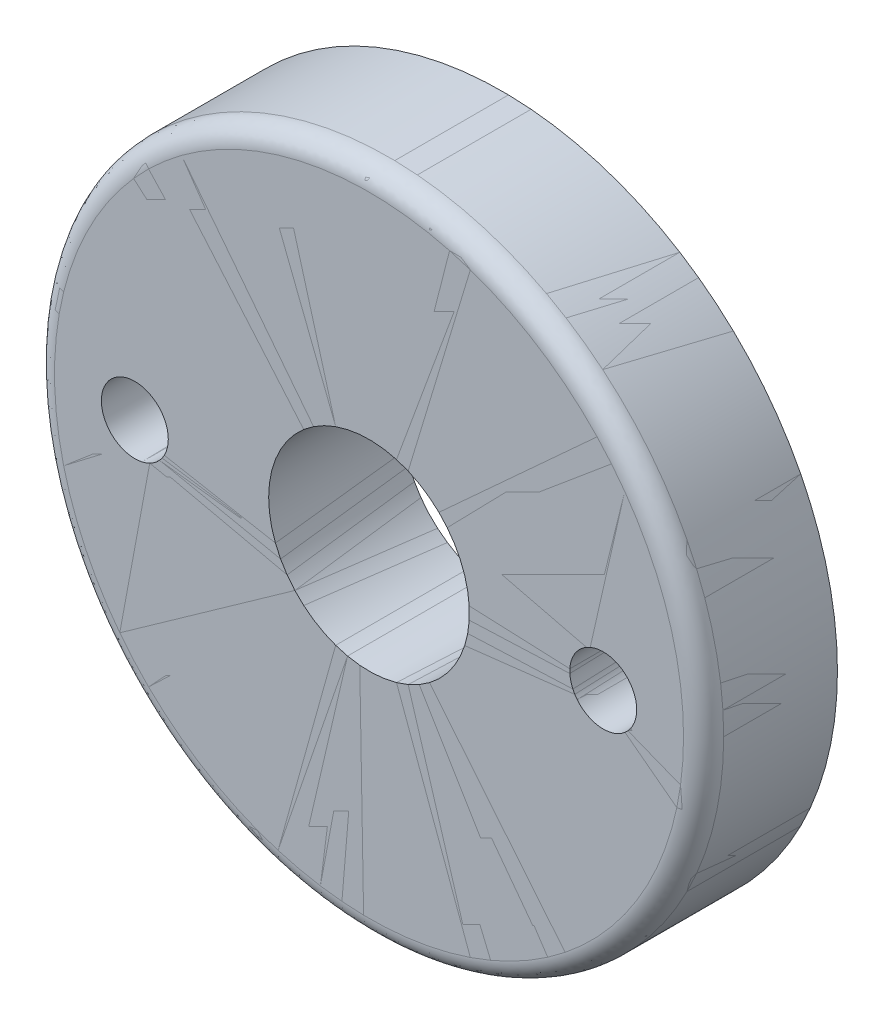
ISO-10303-21;
HEADER;
FILE_DESCRIPTION(('STEP AP214'),'2;1');
FILE_NAME('part.step','',(''),(''),'','','');
FILE_SCHEMA(('AUTOMOTIVE_DESIGN { 1 0 10303 214 1 1 1 1 }'));
ENDSEC;
DATA;
#1=APPLICATION_CONTEXT('core data for automotive mechanical design processes');
#2=APPLICATION_PROTOCOL_DEFINITION('international standard','automotive_design',2000,#1);
#3=PRODUCT_CONTEXT('',#1,'mechanical');
#4=PRODUCT('Part','Part','',(#3));
#5=PRODUCT_RELATED_PRODUCT_CATEGORY('part','',(#4));
#6=PRODUCT_DEFINITION_FORMATION('','',#4);
#7=PRODUCT_DEFINITION_CONTEXT('part definition',#1,'design');
#8=PRODUCT_DEFINITION('design','',#6,#7);
#9=PRODUCT_DEFINITION_SHAPE('','',#8);
#10=(LENGTH_UNIT() NAMED_UNIT(*) SI_UNIT(.MILLI.,.METRE.));
#11=(NAMED_UNIT(*) PLANE_ANGLE_UNIT() SI_UNIT($,.RADIAN.));
#12=(NAMED_UNIT(*) SI_UNIT($,.STERADIAN.) SOLID_ANGLE_UNIT());
#13=UNCERTAINTY_MEASURE_WITH_UNIT(LENGTH_MEASURE(1.E-05),#10,'distance_accuracy_value','');
#14=(GEOMETRIC_REPRESENTATION_CONTEXT(3) GLOBAL_UNCERTAINTY_ASSIGNED_CONTEXT((#13)) GLOBAL_UNIT_ASSIGNED_CONTEXT((#10,
#11,#12)) REPRESENTATION_CONTEXT('',''));
#15=CARTESIAN_POINT('',(0.,0.,0.));
#16=DIRECTION('',(0.,0.,1.));
#17=DIRECTION('',(1.,0.,0.));
#18=AXIS2_PLACEMENT_3D('',#15,#16,#17);
#19=CARTESIAN_POINT('',(4.7,0.,0.));
#20=CARTESIAN_POINT('',(5.,0.,0.));
#21=CARTESIAN_POINT('',(5.,0.,-0.3));
#22=CARTESIAN_POINT('',(5.,0.,-0.6));
#23=CARTESIAN_POINT('',(4.7,0.,-0.6));
#24=CARTESIAN_POINT('',(4.4,0.,-0.6));
#25=CARTESIAN_POINT('',(4.4,0.,-0.3));
#26=CARTESIAN_POINT('',(4.4,0.,0.));
#27=CARTESIAN_POINT('',(4.7,0.,0.));
#28=(BOUNDED_CURVE() B_SPLINE_CURVE(2,(#19,#20,#21,#22,#23,#24,#25,#26,#27),.UNSPECIFIED.,.T.,
.F.) B_SPLINE_CURVE_WITH_KNOTS((3,2,2,2,3),(0.,0.25,0.5,0.75,1.),
.UNSPECIFIED.) CURVE() GEOMETRIC_REPRESENTATION_ITEM() RATIONAL_B_SPLINE_CURVE((1.,
0.70710678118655,1.,0.70710678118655,1.,0.70710678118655,1.,0.70710678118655,1.)) REPRESENTATION_ITEM(''));
#29=CARTESIAN_POINT('',(0.,0.,-0.6));
#30=DIRECTION('',(0.,0.,1.));
#31=AXIS1_PLACEMENT('',#29,#30);
#32=SURFACE_OF_REVOLUTION('',#28,#31);
#33=CARTESIAN_POINT('',(0.,0.,-0.3));
#34=DIRECTION('',(0.,0.,1.));
#35=DIRECTION('',(1.,0.,0.));
#36=AXIS2_PLACEMENT_3D('',#33,#34,#35);
#37=CIRCLE('',#36,5.);
#38=CARTESIAN_POINT('',(5.,0.,-0.3));
#39=VERTEX_POINT('',#38);
#40=EDGE_CURVE('P0_E396',#39,#39,#37,.T.);
#41=ORIENTED_EDGE('',*,*,#40,.T.);
#42=EDGE_LOOP('',(#41));
#43=FACE_BOUND('',#42,.T.);
#44=CARTESIAN_POINT('',(0.,0.,0.));
#45=DIRECTION('',(0.,0.,-1.));
#46=DIRECTION('',(1.,0.,0.));
#47=AXIS2_PLACEMENT_3D('',#44,#45,#46);
#48=CIRCLE('',#47,4.7);
#49=CARTESIAN_POINT('',(4.7,0.,0.));
#50=VERTEX_POINT('',#49);
#51=EDGE_CURVE('P0_E392',#50,#50,#48,.F.);
#52=ORIENTED_EDGE('',*,*,#51,.F.);
#53=EDGE_LOOP('',(#52));
#54=FACE_BOUND('',#53,.T.);
#55=ADVANCED_FACE('P0_F348',(#43,#54),#32,.F.);
#56=CARTESIAN_POINT('',(0.,0.,-2.));
#57=DIRECTION('',(0.,0.,1.));
#58=DIRECTION('',(1.,0.,0.));
#59=AXIS2_PLACEMENT_3D('',#56,#57,#58);
#60=CYLINDRICAL_SURFACE('',#59,5.);
#61=CARTESIAN_POINT('',(0.,0.,-2.));
#62=DIRECTION('',(0.,0.,1.));
#63=DIRECTION('',(1.,0.,0.));
#64=AXIS2_PLACEMENT_3D('',#61,#62,#63);
#65=CIRCLE('',#64,5.);
#66=CARTESIAN_POINT('',(5.,0.,-2.));
#67=VERTEX_POINT('',#66);
#68=EDGE_CURVE('P0_E379',#67,#67,#65,.F.);
#69=ORIENTED_EDGE('',*,*,#68,.F.);
#70=EDGE_LOOP('',(#69));
#71=FACE_BOUND('',#70,.T.);
#72=ORIENTED_EDGE('',*,*,#40,.F.);
#73=EDGE_LOOP('',(#72));
#74=FACE_BOUND('',#73,.T.);
#75=ADVANCED_FACE('P0_F423',(#71,#74),#60,.T.);
#76=CARTESIAN_POINT('',(3.5,0.,-2.));
#77=DIRECTION('',(0.,0.,1.));
#78=DIRECTION('',(1.,0.,0.));
#79=AXIS2_PLACEMENT_3D('',#76,#77,#78);
#80=CYLINDRICAL_SURFACE('',#79,0.5);
#81=CARTESIAN_POINT('',(3.5,0.,-2.));
#82=DIRECTION('',(0.,0.,1.));
#83=DIRECTION('',(1.,0.,0.));
#84=AXIS2_PLACEMENT_3D('',#81,#82,#83);
#85=CIRCLE('',#84,0.5);
#86=CARTESIAN_POINT('',(4.,0.,-2.));
#87=VERTEX_POINT('',#86);
#88=EDGE_CURVE('P0_E374',#87,#87,#85,.T.);
#89=ORIENTED_EDGE('',*,*,#88,.F.);
#90=EDGE_LOOP('',(#89));
#91=FACE_BOUND('',#90,.T.);
#92=CARTESIAN_POINT('',(3.5,0.,0.));
#93=DIRECTION('',(0.,0.,1.));
#94=DIRECTION('',(1.,0.,0.));
#95=AXIS2_PLACEMENT_3D('',#92,#93,#94);
#96=CIRCLE('',#95,0.5);
#97=CARTESIAN_POINT('',(4.,0.,0.));
#98=VERTEX_POINT('',#97);
#99=EDGE_CURVE('P0_E389',#98,#98,#96,.F.);
#100=ORIENTED_EDGE('',*,*,#99,.F.);
#101=EDGE_LOOP('',(#100));
#102=FACE_BOUND('',#101,.T.);
#103=ADVANCED_FACE('P0_F426',(#91,#102),#80,.F.);
#104=CARTESIAN_POINT('',(-3.5,0.,-2.));
#105=DIRECTION('',(0.,0.,1.));
#106=DIRECTION('',(1.,0.,0.));
#107=AXIS2_PLACEMENT_3D('',#104,#105,#106);
#108=CYLINDRICAL_SURFACE('',#107,0.5);
#109=CARTESIAN_POINT('',(-3.5,0.,-2.));
#110=DIRECTION('',(0.,0.,1.));
#111=DIRECTION('',(1.,0.,0.));
#112=AXIS2_PLACEMENT_3D('',#109,#110,#111);
#113=CIRCLE('',#112,0.5);
#114=CARTESIAN_POINT('',(-3.,0.,-2.));
#115=VERTEX_POINT('',#114);
#116=EDGE_CURVE('P0_E361',#115,#115,#113,.T.);
#117=ORIENTED_EDGE('',*,*,#116,.F.);
#118=EDGE_LOOP('',(#117));
#119=FACE_BOUND('',#118,.T.);
#120=CARTESIAN_POINT('',(-3.5,0.,0.));
#121=DIRECTION('',(0.,0.,1.));
#122=DIRECTION('',(1.,0.,0.));
#123=AXIS2_PLACEMENT_3D('',#120,#121,#122);
#124=CIRCLE('',#123,0.5);
#125=CARTESIAN_POINT('',(-3.,0.,0.));
#126=VERTEX_POINT('',#125);
#127=EDGE_CURVE('P0_E384',#126,#126,#124,.F.);
#128=ORIENTED_EDGE('',*,*,#127,.F.);
#129=EDGE_LOOP('',(#128));
#130=FACE_BOUND('',#129,.T.);
#131=ADVANCED_FACE('P0_F430',(#119,#130),#108,.F.);
#132=CARTESIAN_POINT('',(-4.7,-4.7,0.));
#133=DIRECTION('',(0.,0.,1.));
#134=DIRECTION('',(1.,0.,0.));
#135=AXIS2_PLACEMENT_3D('',#132,#133,#134);
#136=PLANE('',#135);
#137=ORIENTED_EDGE('',*,*,#127,.T.);
#138=EDGE_LOOP('',(#137));
#139=FACE_BOUND('',#138,.T.);
#140=ORIENTED_EDGE('',*,*,#99,.T.);
#141=EDGE_LOOP('',(#140));
#142=FACE_BOUND('',#141,.T.);
#143=CARTESIAN_POINT('',(0.,0.,0.));
#144=DIRECTION('',(0.,0.,-1.));
#145=DIRECTION('',(-1.,0.,0.));
#146=AXIS2_PLACEMENT_3D('',#143,#144,#145);
#147=CIRCLE('',#146,1.5);
#148=CARTESIAN_POINT('',(-1.5,0.,0.));
#149=VERTEX_POINT('',#148);
#150=EDGE_CURVE('P0_E356',#149,#149,#147,.F.);
#151=ORIENTED_EDGE('',*,*,#150,.F.);
#152=EDGE_LOOP('',(#151));
#153=FACE_BOUND('',#152,.T.);
#154=ORIENTED_EDGE('',*,*,#51,.T.);
#155=EDGE_LOOP('',(#154));
#156=FACE_BOUND('',#155,.T.);
#157=ADVANCED_FACE('P0_F434',(#139,#142,#153,#156),#136,.T.);
#158=CARTESIAN_POINT('',(5.,-5.,-2.));
#159=DIRECTION('',(0.,0.,-1.));
#160=DIRECTION('',(-1.,0.,0.));
#161=AXIS2_PLACEMENT_3D('',#158,#159,#160);
#162=PLANE('',#161);
#163=ORIENTED_EDGE('',*,*,#116,.T.);
#164=EDGE_LOOP('',(#163));
#165=FACE_BOUND('',#164,.T.);
#166=ORIENTED_EDGE('',*,*,#88,.T.);
#167=EDGE_LOOP('',(#166));
#168=FACE_BOUND('',#167,.T.);
#169=CARTESIAN_POINT('',(0.,0.,-2.));
#170=DIRECTION('',(0.,0.,-1.));
#171=DIRECTION('',(-1.,0.,0.));
#172=AXIS2_PLACEMENT_3D('',#169,#170,#171);
#173=CIRCLE('',#172,1.5);
#174=CARTESIAN_POINT('',(-1.5,0.,-2.));
#175=VERTEX_POINT('',#174);
#176=EDGE_CURVE('P0_E10',#175,#175,#173,.T.);
#177=ORIENTED_EDGE('',*,*,#176,.F.);
#178=EDGE_LOOP('',(#177));
#179=FACE_BOUND('',#178,.T.);
#180=ORIENTED_EDGE('',*,*,#68,.T.);
#181=EDGE_LOOP('',(#180));
#182=FACE_BOUND('',#181,.T.);
#183=ADVANCED_FACE('P0_F350',(#165,#168,#179,#182),#162,.T.);
#184=CARTESIAN_POINT('',(0.,0.,0.));
#185=DIRECTION('',(0.,0.,-1.));
#186=DIRECTION('',(-1.,0.,0.));
#187=AXIS2_PLACEMENT_3D('',#184,#185,#186);
#188=CYLINDRICAL_SURFACE('',#187,1.5);
#189=ORIENTED_EDGE('',*,*,#176,.T.);
#190=EDGE_LOOP('',(#189));
#191=FACE_BOUND('',#190,.T.);
#192=ORIENTED_EDGE('',*,*,#150,.T.);
#193=EDGE_LOOP('',(#192));
#194=FACE_BOUND('',#193,.T.);
#195=ADVANCED_FACE('P0_F436',(#191,#194),#188,.F.);
#196=CLOSED_SHELL('',(#55,#75,#103,#131,#157,#183,#195));
#197=MANIFOLD_SOLID_BREP('P0_B2',#196);
#198=CARTESIAN_POINT('',(4.7,0.,0.));
#199=CARTESIAN_POINT('',(5.,0.,0.));
#200=CARTESIAN_POINT('',(5.,0.,-0.3));
#201=CARTESIAN_POINT('',(5.,0.,-0.6));
#202=CARTESIAN_POINT('',(4.7,0.,-0.6));
#203=CARTESIAN_POINT('',(4.4,0.,-0.6));
#204=CARTESIAN_POINT('',(4.4,0.,-0.3));
#205=CARTESIAN_POINT('',(4.4,0.,0.));
#206=CARTESIAN_POINT('',(4.7,0.,0.));
#207=(BOUNDED_CURVE() B_SPLINE_CURVE(2,(#198,#199,#200,#201,#202,#203,#204,#205,#206),
.UNSPECIFIED.,.T.,.F.) B_SPLINE_CURVE_WITH_KNOTS((3,2,2,2,3),(0.,0.25,0.5,0.75,1.),
.UNSPECIFIED.) CURVE() GEOMETRIC_REPRESENTATION_ITEM() RATIONAL_B_SPLINE_CURVE((1.,
0.70710678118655,1.,0.70710678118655,1.,0.70710678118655,1.,0.70710678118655,1.)) REPRESENTATION_ITEM(''));
#208=CARTESIAN_POINT('',(0.,0.,-0.6));
#209=DIRECTION('',(0.,0.,1.));
#210=AXIS1_PLACEMENT('',#208,#209);
#211=SURFACE_OF_REVOLUTION('',#207,#210);
#212=CARTESIAN_POINT('',(0.,0.,-0.3));
#213=DIRECTION('',(0.,0.,1.));
#214=DIRECTION('',(1.,0.,0.));
#215=AXIS2_PLACEMENT_3D('',#212,#213,#214);
#216=CIRCLE('',#215,5.);
#217=CARTESIAN_POINT('',(5.,0.,-0.3));
#218=VERTEX_POINT('',#217);
#219=EDGE_CURVE('P1_E62',#218,#218,#216,.T.);
#220=ORIENTED_EDGE('',*,*,#219,.T.);
#221=EDGE_LOOP('',(#220));
#222=FACE_BOUND('',#221,.T.);
#223=CARTESIAN_POINT('',(0.,0.,0.));
#224=DIRECTION('',(0.,0.,-1.));
#225=DIRECTION('',(1.,0.,0.));
#226=AXIS2_PLACEMENT_3D('',#223,#224,#225);
#227=CIRCLE('',#226,4.7);
#228=CARTESIAN_POINT('',(4.7,0.,0.));
#229=VERTEX_POINT('',#228);
#230=EDGE_CURVE('P1_E58',#229,#229,#227,.F.);
#231=ORIENTED_EDGE('',*,*,#230,.F.);
#232=EDGE_LOOP('',(#231));
#233=FACE_BOUND('',#232,.T.);
#234=ADVANCED_FACE('P1_F14',(#222,#233),#211,.F.);
#235=CARTESIAN_POINT('',(0.,0.,-2.));
#236=DIRECTION('',(0.,0.,1.));
#237=DIRECTION('',(1.,0.,0.));
#238=AXIS2_PLACEMENT_3D('',#235,#236,#237);
#239=CYLINDRICAL_SURFACE('',#238,5.);
#240=CARTESIAN_POINT('',(0.,0.,-2.));
#241=DIRECTION('',(0.,0.,1.));
#242=DIRECTION('',(1.,0.,0.));
#243=AXIS2_PLACEMENT_3D('',#240,#241,#242);
#244=CIRCLE('',#243,5.);
#245=CARTESIAN_POINT('',(5.,0.,-2.));
#246=VERTEX_POINT('',#245);
#247=EDGE_CURVE('P1_E45',#246,#246,#244,.F.);
#248=ORIENTED_EDGE('',*,*,#247,.F.);
#249=EDGE_LOOP('',(#248));
#250=FACE_BOUND('',#249,.T.);
#251=ORIENTED_EDGE('',*,*,#219,.F.);
#252=EDGE_LOOP('',(#251));
#253=FACE_BOUND('',#252,.T.);
#254=ADVANCED_FACE('P1_F88',(#250,#253),#239,.T.);
#255=CARTESIAN_POINT('',(3.5,0.,-2.));
#256=DIRECTION('',(0.,0.,1.));
#257=DIRECTION('',(1.,0.,0.));
#258=AXIS2_PLACEMENT_3D('',#255,#256,#257);
#259=CYLINDRICAL_SURFACE('',#258,0.5);
#260=CARTESIAN_POINT('',(3.5,0.,-2.));
#261=DIRECTION('',(0.,0.,1.));
#262=DIRECTION('',(1.,0.,0.));
#263=AXIS2_PLACEMENT_3D('',#260,#261,#262);
#264=CIRCLE('',#263,0.5);
#265=CARTESIAN_POINT('',(4.,0.,-2.));
#266=VERTEX_POINT('',#265);
#267=EDGE_CURVE('P1_E40',#266,#266,#264,.T.);
#268=ORIENTED_EDGE('',*,*,#267,.F.);
#269=EDGE_LOOP('',(#268));
#270=FACE_BOUND('',#269,.T.);
#271=CARTESIAN_POINT('',(3.5,0.,0.));
#272=DIRECTION('',(0.,0.,1.));
#273=DIRECTION('',(1.,0.,0.));
#274=AXIS2_PLACEMENT_3D('',#271,#272,#273);
#275=CIRCLE('',#274,0.5);
#276=CARTESIAN_POINT('',(4.,0.,0.));
#277=VERTEX_POINT('',#276);
#278=EDGE_CURVE('P1_E55',#277,#277,#275,.F.);
#279=ORIENTED_EDGE('',*,*,#278,.F.);
#280=EDGE_LOOP('',(#279));
#281=FACE_BOUND('',#280,.T.);
#282=ADVANCED_FACE('P1_F90',(#270,#281),#259,.F.);
#283=CARTESIAN_POINT('',(-3.5,0.,-2.));
#284=DIRECTION('',(0.,0.,1.));
#285=DIRECTION('',(1.,0.,0.));
#286=AXIS2_PLACEMENT_3D('',#283,#284,#285);
#287=CYLINDRICAL_SURFACE('',#286,0.5);
#288=CARTESIAN_POINT('',(-3.5,0.,-2.));
#289=DIRECTION('',(0.,0.,1.));
#290=DIRECTION('',(1.,0.,0.));
#291=AXIS2_PLACEMENT_3D('',#288,#289,#290);
#292=CIRCLE('',#291,0.5);
#293=CARTESIAN_POINT('',(-3.,0.,-2.));
#294=VERTEX_POINT('',#293);
#295=EDGE_CURVE('P1_E27',#294,#294,#292,.T.);
#296=ORIENTED_EDGE('',*,*,#295,.F.);
#297=EDGE_LOOP('',(#296));
#298=FACE_BOUND('',#297,.T.);
#299=CARTESIAN_POINT('',(-3.5,0.,0.));
#300=DIRECTION('',(0.,0.,1.));
#301=DIRECTION('',(1.,0.,0.));
#302=AXIS2_PLACEMENT_3D('',#299,#300,#301);
#303=CIRCLE('',#302,0.5);
#304=CARTESIAN_POINT('',(-3.,0.,0.));
#305=VERTEX_POINT('',#304);
#306=EDGE_CURVE('P1_E50',#305,#305,#303,.F.);
#307=ORIENTED_EDGE('',*,*,#306,.F.);
#308=EDGE_LOOP('',(#307));
#309=FACE_BOUND('',#308,.T.);
#310=ADVANCED_FACE('P1_F93',(#298,#309),#287,.F.);
#311=CARTESIAN_POINT('',(-4.7,-4.7,0.));
#312=DIRECTION('',(0.,0.,1.));
#313=DIRECTION('',(1.,0.,0.));
#314=AXIS2_PLACEMENT_3D('',#311,#312,#313);
#315=PLANE('',#314);
#316=ORIENTED_EDGE('',*,*,#306,.T.);
#317=EDGE_LOOP('',(#316));
#318=FACE_BOUND('',#317,.T.);
#319=ORIENTED_EDGE('',*,*,#278,.T.);
#320=EDGE_LOOP('',(#319));
#321=FACE_BOUND('',#320,.T.);
#322=CARTESIAN_POINT('',(0.,0.,0.));
#323=DIRECTION('',(0.,0.,-1.));
#324=DIRECTION('',(-1.,0.,0.));
#325=AXIS2_PLACEMENT_3D('',#322,#323,#324);
#326=CIRCLE('',#325,1.5);
#327=CARTESIAN_POINT('',(-1.5,0.,0.));
#328=VERTEX_POINT('',#327);
#329=EDGE_CURVE('P1_E22',#328,#328,#326,.F.);
#330=ORIENTED_EDGE('',*,*,#329,.F.);
#331=EDGE_LOOP('',(#330));
#332=FACE_BOUND('',#331,.T.);
#333=ORIENTED_EDGE('',*,*,#230,.T.);
#334=EDGE_LOOP('',(#333));
#335=FACE_BOUND('',#334,.T.);
#336=ADVANCED_FACE('P1_F96',(#318,#321,#332,#335),#315,.T.);
#337=CARTESIAN_POINT('',(5.,-5.,-2.));
#338=DIRECTION('',(0.,0.,-1.));
#339=DIRECTION('',(-1.,0.,0.));
#340=AXIS2_PLACEMENT_3D('',#337,#338,#339);
#341=PLANE('',#340);
#342=ORIENTED_EDGE('',*,*,#295,.T.);
#343=EDGE_LOOP('',(#342));
#344=FACE_BOUND('',#343,.T.);
#345=ORIENTED_EDGE('',*,*,#267,.T.);
#346=EDGE_LOOP('',(#345));
#347=FACE_BOUND('',#346,.T.);
#348=CARTESIAN_POINT('',(0.,0.,-2.));
#349=DIRECTION('',(0.,0.,-1.));
#350=DIRECTION('',(-1.,0.,0.));
#351=AXIS2_PLACEMENT_3D('',#348,#349,#350);
#352=CIRCLE('',#351,1.5);
#353=CARTESIAN_POINT('',(-1.5,0.,-2.));
#354=VERTEX_POINT('',#353);
#355=EDGE_CURVE('P1_E9',#354,#354,#352,.T.);
#356=ORIENTED_EDGE('',*,*,#355,.F.);
#357=EDGE_LOOP('',(#356));
#358=FACE_BOUND('',#357,.T.);
#359=ORIENTED_EDGE('',*,*,#247,.T.);
#360=EDGE_LOOP('',(#359));
#361=FACE_BOUND('',#360,.T.);
#362=ADVANCED_FACE('P1_F16',(#344,#347,#358,#361),#341,.T.);
#363=CARTESIAN_POINT('',(0.,0.,0.));
#364=DIRECTION('',(0.,0.,-1.));
#365=DIRECTION('',(-1.,0.,0.));
#366=AXIS2_PLACEMENT_3D('',#363,#364,#365);
#367=CYLINDRICAL_SURFACE('',#366,1.5);
#368=ORIENTED_EDGE('',*,*,#355,.T.);
#369=EDGE_LOOP('',(#368));
#370=FACE_BOUND('',#369,.T.);
#371=ORIENTED_EDGE('',*,*,#329,.T.);
#372=EDGE_LOOP('',(#371));
#373=FACE_BOUND('',#372,.T.);
#374=ADVANCED_FACE('P1_F98',(#370,#373),#367,.F.);
#375=CLOSED_SHELL('',(#234,#254,#282,#310,#336,#362,#374));
#376=MANIFOLD_SOLID_BREP('P1_B1',#375);
#377=ADVANCED_BREP_SHAPE_REPRESENTATION('',(#18,#197,#376),#14);
#378=SHAPE_DEFINITION_REPRESENTATION(#9,#377);
ENDSEC;
END-ISO-10303-21;
